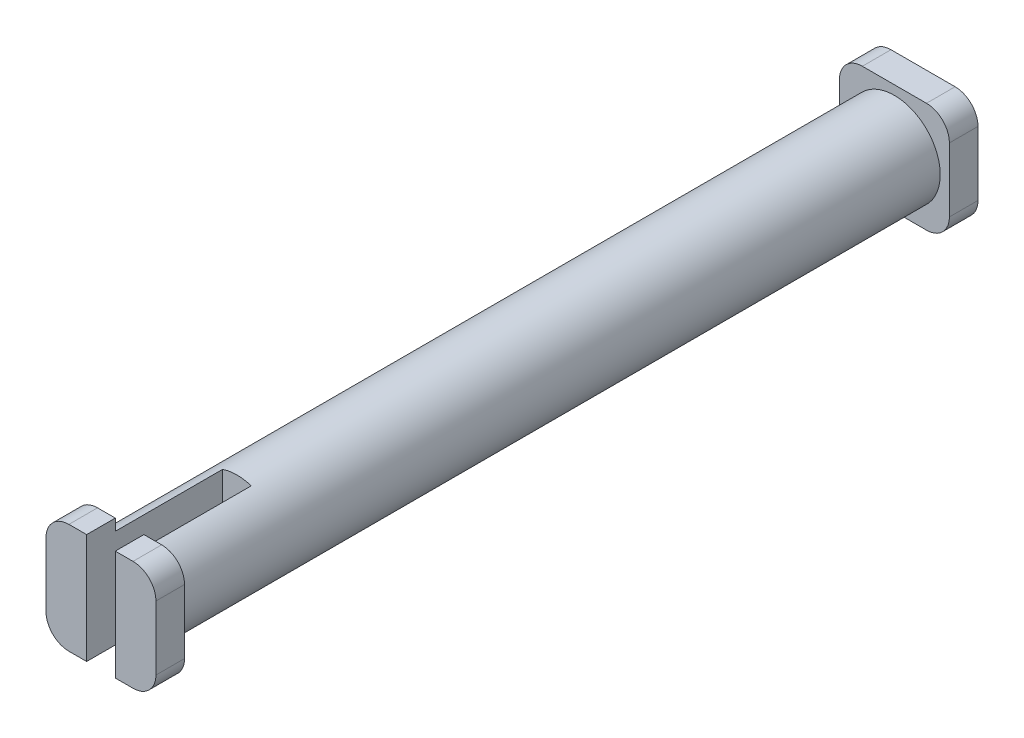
ISO-10303-21;
HEADER;
FILE_DESCRIPTION(('STEP AP214'),'2;1');
FILE_NAME('part.step','',(''),(''),'','','');
FILE_SCHEMA(('AUTOMOTIVE_DESIGN { 1 0 10303 214 1 1 1 1 }'));
ENDSEC;
DATA;
#1=APPLICATION_CONTEXT('core data for automotive mechanical design processes');
#2=APPLICATION_PROTOCOL_DEFINITION('international standard','automotive_design',2000,#1);
#3=PRODUCT_CONTEXT('',#1,'mechanical');
#4=PRODUCT('Part','Part','',(#3));
#5=PRODUCT_RELATED_PRODUCT_CATEGORY('part','',(#4));
#6=PRODUCT_DEFINITION_FORMATION('','',#4);
#7=PRODUCT_DEFINITION_CONTEXT('part definition',#1,'design');
#8=PRODUCT_DEFINITION('design','',#6,#7);
#9=PRODUCT_DEFINITION_SHAPE('','',#8);
#10=(LENGTH_UNIT() NAMED_UNIT(*) SI_UNIT(.MILLI.,.METRE.));
#11=(NAMED_UNIT(*) PLANE_ANGLE_UNIT() SI_UNIT($,.RADIAN.));
#12=(NAMED_UNIT(*) SI_UNIT($,.STERADIAN.) SOLID_ANGLE_UNIT());
#13=UNCERTAINTY_MEASURE_WITH_UNIT(LENGTH_MEASURE(1.E-05),#10,'distance_accuracy_value','');
#14=(GEOMETRIC_REPRESENTATION_CONTEXT(3) GLOBAL_UNCERTAINTY_ASSIGNED_CONTEXT((#13)) GLOBAL_UNIT_ASSIGNED_CONTEXT((#10,
#11,#12)) REPRESENTATION_CONTEXT('',''));
#15=CARTESIAN_POINT('',(0.,0.,0.));
#16=DIRECTION('',(0.,0.,1.));
#17=DIRECTION('',(1.,0.,0.));
#18=AXIS2_PLACEMENT_3D('',#15,#16,#17);
#19=CARTESIAN_POINT('',(1.27000000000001,0.,44.0055));
#20=DIRECTION('',(0.,-1.,0.));
#21=DIRECTION('',(0.,0.,-1.));
#22=AXIS2_PLACEMENT_3D('',#19,#20,#21);
#23=PLANE('',#22);
#24=DIRECTION('',(0.,0.,1.));
#25=VECTOR('',#24,1.);
#26=CARTESIAN_POINT('',(2.25425,0.,38.052375));
#27=LINE('',#26,#25);
#28=CARTESIAN_POINT('',(2.25425,0.,44.0055));
#29=VERTEX_POINT('',#28);
#30=CARTESIAN_POINT('',(2.25425,0.,45.593));
#31=VERTEX_POINT('',#30);
#32=EDGE_CURVE('E371',#29,#31,#27,.T.);
#33=ORIENTED_EDGE('',*,*,#32,.T.);
#34=DIRECTION('',(1.,0.,0.));
#35=VECTOR('',#34,1.);
#36=CARTESIAN_POINT('',(1.27000000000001,0.,45.593));
#37=LINE('',#36,#35);
#38=CARTESIAN_POINT('',(1.27000000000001,0.,45.593));
#39=VERTEX_POINT('',#38);
#40=EDGE_CURVE('E321',#39,#31,#37,.T.);
#41=ORIENTED_EDGE('',*,*,#40,.F.);
#42=DIRECTION('',(0.,0.,1.));
#43=VECTOR('',#42,1.);
#44=CARTESIAN_POINT('',(1.27000000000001,0.,44.0055));
#45=LINE('',#44,#43);
#46=CARTESIAN_POINT('',(1.27000000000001,0.,44.0055));
#47=VERTEX_POINT('',#46);
#48=EDGE_CURVE('E229',#47,#39,#45,.T.);
#49=ORIENTED_EDGE('',*,*,#48,.F.);
#50=DIRECTION('',(1.,0.,0.));
#51=VECTOR('',#50,1.);
#52=CARTESIAN_POINT('',(1.27000000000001,0.,44.0055));
#53=LINE('',#52,#51);
#54=EDGE_CURVE('E283',#47,#29,#53,.T.);
#55=ORIENTED_EDGE('',*,*,#54,.T.);
#56=EDGE_LOOP('',(#33,#41,#49,#55));
#57=FACE_BOUND('',#56,.T.);
#58=ADVANCED_FACE('F39',(#57),#23,.T.);
#59=CARTESIAN_POINT('',(1.27,6.096,44.0055));
#60=DIRECTION('',(0.,1.,0.));
#61=DIRECTION('',(0.,0.,1.));
#62=AXIS2_PLACEMENT_3D('',#59,#60,#61);
#63=PLANE('',#62);
#64=DIRECTION('',(0.,0.,1.));
#65=VECTOR('',#64,1.);
#66=CARTESIAN_POINT('',(2.25425,6.096,38.052375));
#67=LINE('',#66,#65);
#68=CARTESIAN_POINT('',(2.25425,6.096,44.0055));
#69=VERTEX_POINT('',#68);
#70=CARTESIAN_POINT('',(2.25425,6.096,45.593));
#71=VERTEX_POINT('',#70);
#72=EDGE_CURVE('E362',#69,#71,#67,.T.);
#73=ORIENTED_EDGE('',*,*,#72,.F.);
#74=DIRECTION('',(-1.,0.,0.));
#75=VECTOR('',#74,1.);
#76=CARTESIAN_POINT('',(1.27,6.096,44.0055));
#77=LINE('',#76,#75);
#78=CARTESIAN_POINT('',(1.27,6.096,44.0055));
#79=VERTEX_POINT('',#78);
#80=EDGE_CURVE('E268',#69,#79,#77,.T.);
#81=ORIENTED_EDGE('',*,*,#80,.T.);
#82=DIRECTION('',(0.,0.,1.));
#83=VECTOR('',#82,1.);
#84=CARTESIAN_POINT('',(1.27,6.096,44.0055));
#85=LINE('',#84,#83);
#86=CARTESIAN_POINT('',(1.27,6.096,45.593));
#87=VERTEX_POINT('',#86);
#88=EDGE_CURVE('E240',#79,#87,#85,.T.);
#89=ORIENTED_EDGE('',*,*,#88,.T.);
#90=DIRECTION('',(-1.,0.,0.));
#91=VECTOR('',#90,1.);
#92=CARTESIAN_POINT('',(1.27,6.096,45.593));
#93=LINE('',#92,#91);
#94=EDGE_CURVE('E306',#71,#87,#93,.T.);
#95=ORIENTED_EDGE('',*,*,#94,.F.);
#96=EDGE_LOOP('',(#73,#81,#89,#95));
#97=FACE_BOUND('',#96,.T.);
#98=ADVANCED_FACE('F517',(#97),#63,.T.);
#99=CARTESIAN_POINT('',(4.826,1.27,44.0055));
#100=DIRECTION('',(0.,0.,-1.));
#101=DIRECTION('',(1.,0.,0.));
#102=AXIS2_PLACEMENT_3D('',#99,#100,#101);
#103=PLANE('',#102);
#104=DIRECTION('',(0.,1.,0.));
#105=VECTOR('',#104,1.);
#106=CARTESIAN_POINT('',(2.25425,1.27,44.0055));
#107=LINE('',#106,#105);
#108=CARTESIAN_POINT('',(2.25425,0.635208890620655,44.0055));
#109=VERTEX_POINT('',#108);
#110=EDGE_CURVE('E336',#29,#109,#107,.T.);
#111=ORIENTED_EDGE('',*,*,#110,.F.);
#112=ORIENTED_EDGE('',*,*,#54,.F.);
#113=CARTESIAN_POINT('',(1.27,1.27,44.0055));
#114=DIRECTION('',(0.,0.,1.));
#115=DIRECTION('',(-1.,0.,0.));
#116=AXIS2_PLACEMENT_3D('',#113,#114,#115);
#117=CIRCLE('',#116,1.27);
#118=CARTESIAN_POINT('',(0.,1.27,44.0055));
#119=VERTEX_POINT('',#118);
#120=EDGE_CURVE('E279',#119,#47,#117,.T.);
#121=ORIENTED_EDGE('',*,*,#120,.F.);
#122=DIRECTION('',(0.,-1.,0.));
#123=VECTOR('',#122,1.);
#124=CARTESIAN_POINT('',(0.,1.27000000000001,44.0055));
#125=LINE('',#124,#123);
#126=CARTESIAN_POINT('',(0.,4.826,44.0055));
#127=VERTEX_POINT('',#126);
#128=EDGE_CURVE('E275',#127,#119,#125,.T.);
#129=ORIENTED_EDGE('',*,*,#128,.F.);
#130=CARTESIAN_POINT('',(1.27,4.826,44.0055));
#131=DIRECTION('',(0.,0.,1.));
#132=DIRECTION('',(-1.,0.,0.));
#133=AXIS2_PLACEMENT_3D('',#130,#131,#132);
#134=CIRCLE('',#133,1.27);
#135=EDGE_CURVE('E272',#79,#127,#134,.T.);
#136=ORIENTED_EDGE('',*,*,#135,.F.);
#137=ORIENTED_EDGE('',*,*,#80,.F.);
#138=CARTESIAN_POINT('',(2.25425,5.46079110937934,44.0055));
#139=VERTEX_POINT('',#138);
#140=EDGE_CURVE('E342',#139,#69,#107,.T.);
#141=ORIENTED_EDGE('',*,*,#140,.F.);
#142=CARTESIAN_POINT('',(3.048,3.048,44.0055));
#143=DIRECTION('',(0.,0.,1.));
#144=DIRECTION('',(1.,0.,0.));
#145=AXIS2_PLACEMENT_3D('',#142,#143,#144);
#146=CIRCLE('',#145,2.54);
#147=EDGE_CURVE('E159',#139,#109,#146,.T.);
#148=ORIENTED_EDGE('',*,*,#147,.T.);
#149=EDGE_LOOP('',(#111,#112,#121,#129,#136,#137,#141,#148));
#150=FACE_BOUND('',#149,.T.);
#151=ADVANCED_FACE('F513',(#150),#103,.T.);
#152=CARTESIAN_POINT('',(4.826,1.27,45.593));
#153=DIRECTION('',(0.,0.,-1.));
#154=DIRECTION('',(1.,0.,0.));
#155=AXIS2_PLACEMENT_3D('',#152,#153,#154);
#156=PLANE('',#155);
#157=ORIENTED_EDGE('',*,*,#40,.T.);
#158=DIRECTION('',(0.,-1.,0.));
#159=VECTOR('',#158,1.);
#160=CARTESIAN_POINT('',(2.25425,6.096,45.593));
#161=LINE('',#160,#159);
#162=EDGE_CURVE('E386',#71,#31,#161,.T.);
#163=ORIENTED_EDGE('',*,*,#162,.F.);
#164=ORIENTED_EDGE('',*,*,#94,.T.);
#165=CARTESIAN_POINT('',(1.27,4.826,45.593));
#166=DIRECTION('',(0.,0.,1.));
#167=DIRECTION('',(-1.,0.,0.));
#168=AXIS2_PLACEMENT_3D('',#165,#166,#167);
#169=CIRCLE('',#168,1.27);
#170=CARTESIAN_POINT('',(0.,4.826,45.593));
#171=VERTEX_POINT('',#170);
#172=EDGE_CURVE('E310',#87,#171,#169,.T.);
#173=ORIENTED_EDGE('',*,*,#172,.T.);
#174=DIRECTION('',(0.,-1.,0.));
#175=VECTOR('',#174,1.);
#176=CARTESIAN_POINT('',(0.,1.27000000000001,45.593));
#177=LINE('',#176,#175);
#178=CARTESIAN_POINT('',(0.,1.27,45.593));
#179=VERTEX_POINT('',#178);
#180=EDGE_CURVE('E313',#171,#179,#177,.T.);
#181=ORIENTED_EDGE('',*,*,#180,.T.);
#182=CARTESIAN_POINT('',(1.27,1.27,45.593));
#183=DIRECTION('',(0.,0.,1.));
#184=DIRECTION('',(-1.,0.,0.));
#185=AXIS2_PLACEMENT_3D('',#182,#183,#184);
#186=CIRCLE('',#185,1.27);
#187=EDGE_CURVE('E317',#179,#39,#186,.T.);
#188=ORIENTED_EDGE('',*,*,#187,.T.);
#189=EDGE_LOOP('',(#157,#163,#164,#173,#181,#188));
#190=FACE_BOUND('',#189,.T.);
#191=ADVANCED_FACE('F409',(#190),#156,.F.);
#192=CARTESIAN_POINT('',(4.826,1.27,1.5875));
#193=DIRECTION('',(0.,0.,-1.));
#194=DIRECTION('',(-1.,0.,0.));
#195=AXIS2_PLACEMENT_3D('',#192,#193,#194);
#196=CYLINDRICAL_SURFACE('',#195,1.27);
#197=CARTESIAN_POINT('',(4.826,1.27,0.));
#198=DIRECTION('',(0.,0.,1.));
#199=DIRECTION('',(1.,0.,0.));
#200=AXIS2_PLACEMENT_3D('',#197,#198,#199);
#201=CIRCLE('',#200,1.27);
#202=CARTESIAN_POINT('',(4.826,0.,0.));
#203=VERTEX_POINT('',#202);
#204=CARTESIAN_POINT('',(6.096,1.27,0.));
#205=VERTEX_POINT('',#204);
#206=EDGE_CURVE('E154',#203,#205,#201,.T.);
#207=ORIENTED_EDGE('',*,*,#206,.T.);
#208=DIRECTION('',(0.,0.,-1.));
#209=VECTOR('',#208,1.);
#210=CARTESIAN_POINT('',(6.096,1.27,1.5875));
#211=LINE('',#210,#209);
#212=CARTESIAN_POINT('',(6.096,1.27,1.5875));
#213=VERTEX_POINT('',#212);
#214=EDGE_CURVE('E196',#213,#205,#211,.T.);
#215=ORIENTED_EDGE('',*,*,#214,.F.);
#216=CARTESIAN_POINT('',(4.826,1.27,1.5875));
#217=DIRECTION('',(0.,0.,1.));
#218=DIRECTION('',(1.,0.,0.));
#219=AXIS2_PLACEMENT_3D('',#216,#217,#218);
#220=CIRCLE('',#219,1.27);
#221=CARTESIAN_POINT('',(4.826,0.,1.5875));
#222=VERTEX_POINT('',#221);
#223=EDGE_CURVE('E178',#222,#213,#220,.T.);
#224=ORIENTED_EDGE('',*,*,#223,.F.);
#225=DIRECTION('',(0.,0.,-1.));
#226=VECTOR('',#225,1.);
#227=CARTESIAN_POINT('',(4.826,0.,1.5875));
#228=LINE('',#227,#226);
#229=EDGE_CURVE('E150',#222,#203,#228,.T.);
#230=ORIENTED_EDGE('',*,*,#229,.T.);
#231=EDGE_LOOP('',(#207,#215,#224,#230));
#232=FACE_BOUND('',#231,.T.);
#233=ADVANCED_FACE('F41',(#232),#196,.T.);
#234=CARTESIAN_POINT('',(6.096,1.27,1.5875));
#235=DIRECTION('',(-1.,0.,0.));
#236=DIRECTION('',(0.,-1.,0.));
#237=AXIS2_PLACEMENT_3D('',#234,#235,#236);
#238=PLANE('',#237);
#239=DIRECTION('',(0.,1.,0.));
#240=VECTOR('',#239,1.);
#241=CARTESIAN_POINT('',(6.096,1.27,0.));
#242=LINE('',#241,#240);
#243=CARTESIAN_POINT('',(6.096,4.826,0.));
#244=VERTEX_POINT('',#243);
#245=EDGE_CURVE('E158',#205,#244,#242,.T.);
#246=ORIENTED_EDGE('',*,*,#245,.T.);
#247=DIRECTION('',(0.,0.,-1.));
#248=VECTOR('',#247,1.);
#249=CARTESIAN_POINT('',(6.096,4.826,1.5875));
#250=LINE('',#249,#248);
#251=CARTESIAN_POINT('',(6.096,4.826,1.5875));
#252=VERTEX_POINT('',#251);
#253=EDGE_CURVE('E193',#252,#244,#250,.T.);
#254=ORIENTED_EDGE('',*,*,#253,.F.);
#255=DIRECTION('',(0.,1.,0.));
#256=VECTOR('',#255,1.);
#257=CARTESIAN_POINT('',(6.096,1.27,1.5875));
#258=LINE('',#257,#256);
#259=EDGE_CURVE('E106',#213,#252,#258,.T.);
#260=ORIENTED_EDGE('',*,*,#259,.F.);
#261=ORIENTED_EDGE('',*,*,#214,.T.);
#262=EDGE_LOOP('',(#246,#254,#260,#261));
#263=FACE_BOUND('',#262,.T.);
#264=ADVANCED_FACE('F706',(#263),#238,.F.);
#265=CARTESIAN_POINT('',(4.826,4.826,1.5875));
#266=DIRECTION('',(0.,0.,-1.));
#267=DIRECTION('',(-1.,0.,0.));
#268=AXIS2_PLACEMENT_3D('',#265,#266,#267);
#269=CYLINDRICAL_SURFACE('',#268,1.27);
#270=CARTESIAN_POINT('',(4.826,4.826,0.));
#271=DIRECTION('',(0.,0.,1.));
#272=DIRECTION('',(-1.,0.,0.));
#273=AXIS2_PLACEMENT_3D('',#270,#271,#272);
#274=CIRCLE('',#273,1.27);
#275=CARTESIAN_POINT('',(4.826,6.096,0.));
#276=VERTEX_POINT('',#275);
#277=EDGE_CURVE('E162',#244,#276,#274,.T.);
#278=ORIENTED_EDGE('',*,*,#277,.T.);
#279=DIRECTION('',(0.,0.,-1.));
#280=VECTOR('',#279,1.);
#281=CARTESIAN_POINT('',(4.826,6.096,1.5875));
#282=LINE('',#281,#280);
#283=CARTESIAN_POINT('',(4.826,6.096,1.5875));
#284=VERTEX_POINT('',#283);
#285=EDGE_CURVE('E189',#284,#276,#282,.T.);
#286=ORIENTED_EDGE('',*,*,#285,.F.);
#287=CARTESIAN_POINT('',(4.826,4.826,1.5875));
#288=DIRECTION('',(0.,0.,1.));
#289=DIRECTION('',(-1.,0.,0.));
#290=AXIS2_PLACEMENT_3D('',#287,#288,#289);
#291=CIRCLE('',#290,1.27);
#292=EDGE_CURVE('E215',#252,#284,#291,.T.);
#293=ORIENTED_EDGE('',*,*,#292,.F.);
#294=ORIENTED_EDGE('',*,*,#253,.T.);
#295=EDGE_LOOP('',(#278,#286,#293,#294));
#296=FACE_BOUND('',#295,.T.);
#297=ADVANCED_FACE('F696',(#296),#269,.T.);
#298=CARTESIAN_POINT('',(1.27,6.096,1.5875));
#299=DIRECTION('',(0.,-1.,0.));
#300=DIRECTION('',(0.,0.,-1.));
#301=AXIS2_PLACEMENT_3D('',#298,#299,#300);
#302=PLANE('',#301);
#303=DIRECTION('',(-1.,0.,0.));
#304=VECTOR('',#303,1.);
#305=CARTESIAN_POINT('',(1.27,6.096,0.));
#306=LINE('',#305,#304);
#307=CARTESIAN_POINT('',(1.27,6.096,0.));
#308=VERTEX_POINT('',#307);
#309=EDGE_CURVE('E165',#276,#308,#306,.T.);
#310=ORIENTED_EDGE('',*,*,#309,.T.);
#311=DIRECTION('',(0.,0.,-1.));
#312=VECTOR('',#311,1.);
#313=CARTESIAN_POINT('',(1.27,6.096,1.5875));
#314=LINE('',#313,#312);
#315=CARTESIAN_POINT('',(1.27,6.096,1.5875));
#316=VERTEX_POINT('',#315);
#317=EDGE_CURVE('E185',#316,#308,#314,.T.);
#318=ORIENTED_EDGE('',*,*,#317,.F.);
#319=DIRECTION('',(-1.,0.,0.));
#320=VECTOR('',#319,1.);
#321=CARTESIAN_POINT('',(1.27,6.096,1.5875));
#322=LINE('',#321,#320);
#323=EDGE_CURVE('E218',#284,#316,#322,.T.);
#324=ORIENTED_EDGE('',*,*,#323,.F.);
#325=ORIENTED_EDGE('',*,*,#285,.T.);
#326=EDGE_LOOP('',(#310,#318,#324,#325));
#327=FACE_BOUND('',#326,.T.);
#328=ADVANCED_FACE('F686',(#327),#302,.F.);
#329=CARTESIAN_POINT('',(1.27,4.826,1.5875));
#330=DIRECTION('',(0.,0.,-1.));
#331=DIRECTION('',(-1.,0.,0.));
#332=AXIS2_PLACEMENT_3D('',#329,#330,#331);
#333=CYLINDRICAL_SURFACE('',#332,1.27);
#334=CARTESIAN_POINT('',(1.27,4.826,0.));
#335=DIRECTION('',(0.,0.,1.));
#336=DIRECTION('',(-1.,0.,0.));
#337=AXIS2_PLACEMENT_3D('',#334,#335,#336);
#338=CIRCLE('',#337,1.27);
#339=CARTESIAN_POINT('',(0.,4.826,0.));
#340=VERTEX_POINT('',#339);
#341=EDGE_CURVE('E168',#308,#340,#338,.T.);
#342=ORIENTED_EDGE('',*,*,#341,.T.);
#343=DIRECTION('',(0.,0.,-1.));
#344=VECTOR('',#343,1.);
#345=CARTESIAN_POINT('',(0.,4.826,1.5875));
#346=LINE('',#345,#344);
#347=CARTESIAN_POINT('',(0.,4.826,1.5875));
#348=VERTEX_POINT('',#347);
#349=EDGE_CURVE('E143',#348,#340,#346,.T.);
#350=ORIENTED_EDGE('',*,*,#349,.F.);
#351=CARTESIAN_POINT('',(1.27,4.826,1.5875));
#352=DIRECTION('',(0.,0.,1.));
#353=DIRECTION('',(-1.,0.,0.));
#354=AXIS2_PLACEMENT_3D('',#351,#352,#353);
#355=CIRCLE('',#354,1.27);
#356=EDGE_CURVE('E129',#316,#348,#355,.T.);
#357=ORIENTED_EDGE('',*,*,#356,.F.);
#358=ORIENTED_EDGE('',*,*,#317,.T.);
#359=EDGE_LOOP('',(#342,#350,#357,#358));
#360=FACE_BOUND('',#359,.T.);
#361=ADVANCED_FACE('F677',(#360),#333,.T.);
#362=CARTESIAN_POINT('',(0.,1.27000000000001,1.5875));
#363=DIRECTION('',(1.,0.,0.));
#364=DIRECTION('',(0.,1.,0.));
#365=AXIS2_PLACEMENT_3D('',#362,#363,#364);
#366=PLANE('',#365);
#367=DIRECTION('',(0.,-1.,0.));
#368=VECTOR('',#367,1.);
#369=CARTESIAN_POINT('',(0.,1.27000000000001,0.));
#370=LINE('',#369,#368);
#371=CARTESIAN_POINT('',(0.,1.27,0.));
#372=VERTEX_POINT('',#371);
#373=EDGE_CURVE('E139',#340,#372,#370,.T.);
#374=ORIENTED_EDGE('',*,*,#373,.T.);
#375=DIRECTION('',(0.,0.,-1.));
#376=VECTOR('',#375,1.);
#377=CARTESIAN_POINT('',(0.,1.27,1.5875));
#378=LINE('',#377,#376);
#379=CARTESIAN_POINT('',(0.,1.27,1.5875));
#380=VERTEX_POINT('',#379);
#381=EDGE_CURVE('E136',#380,#372,#378,.T.);
#382=ORIENTED_EDGE('',*,*,#381,.F.);
#383=DIRECTION('',(0.,-1.,0.));
#384=VECTOR('',#383,1.);
#385=CARTESIAN_POINT('',(0.,1.27000000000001,1.5875));
#386=LINE('',#385,#384);
#387=EDGE_CURVE('E122',#348,#380,#386,.T.);
#388=ORIENTED_EDGE('',*,*,#387,.F.);
#389=ORIENTED_EDGE('',*,*,#349,.T.);
#390=EDGE_LOOP('',(#374,#382,#388,#389));
#391=FACE_BOUND('',#390,.T.);
#392=ADVANCED_FACE('F137',(#391),#366,.F.);
#393=CARTESIAN_POINT('',(1.27,1.27,1.5875));
#394=DIRECTION('',(0.,0.,-1.));
#395=DIRECTION('',(-1.,0.,0.));
#396=AXIS2_PLACEMENT_3D('',#393,#394,#395);
#397=CYLINDRICAL_SURFACE('',#396,1.27);
#398=CARTESIAN_POINT('',(1.27,1.27,0.));
#399=DIRECTION('',(0.,0.,1.));
#400=DIRECTION('',(-1.,0.,0.));
#401=AXIS2_PLACEMENT_3D('',#398,#399,#400);
#402=CIRCLE('',#401,1.27);
#403=CARTESIAN_POINT('',(1.27000000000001,0.,0.));
#404=VERTEX_POINT('',#403);
#405=EDGE_CURVE('E173',#372,#404,#402,.T.);
#406=ORIENTED_EDGE('',*,*,#405,.T.);
#407=DIRECTION('',(0.,0.,-1.));
#408=VECTOR('',#407,1.);
#409=CARTESIAN_POINT('',(1.27000000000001,0.,1.5875));
#410=LINE('',#409,#408);
#411=CARTESIAN_POINT('',(1.27000000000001,0.,1.5875));
#412=VERTEX_POINT('',#411);
#413=EDGE_CURVE('E144',#412,#404,#410,.T.);
#414=ORIENTED_EDGE('',*,*,#413,.F.);
#415=CARTESIAN_POINT('',(1.27,1.27,1.5875));
#416=DIRECTION('',(0.,0.,1.));
#417=DIRECTION('',(-1.,0.,0.));
#418=AXIS2_PLACEMENT_3D('',#415,#416,#417);
#419=CIRCLE('',#418,1.27);
#420=EDGE_CURVE('E126',#380,#412,#419,.T.);
#421=ORIENTED_EDGE('',*,*,#420,.F.);
#422=ORIENTED_EDGE('',*,*,#381,.T.);
#423=EDGE_LOOP('',(#406,#414,#421,#422));
#424=FACE_BOUND('',#423,.T.);
#425=ADVANCED_FACE('F146',(#424),#397,.T.);
#426=CARTESIAN_POINT('',(1.27000000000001,0.,1.5875));
#427=DIRECTION('',(0.,1.,0.));
#428=DIRECTION('',(0.,0.,1.));
#429=AXIS2_PLACEMENT_3D('',#426,#427,#428);
#430=PLANE('',#429);
#431=DIRECTION('',(1.,0.,0.));
#432=VECTOR('',#431,1.);
#433=CARTESIAN_POINT('',(1.27000000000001,0.,0.));
#434=LINE('',#433,#432);
#435=EDGE_CURVE('E97',#404,#203,#434,.T.);
#436=ORIENTED_EDGE('',*,*,#435,.T.);
#437=ORIENTED_EDGE('',*,*,#229,.F.);
#438=DIRECTION('',(1.,0.,0.));
#439=VECTOR('',#438,1.);
#440=CARTESIAN_POINT('',(1.27000000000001,0.,1.5875));
#441=LINE('',#440,#439);
#442=EDGE_CURVE('E64',#412,#222,#441,.T.);
#443=ORIENTED_EDGE('',*,*,#442,.F.);
#444=ORIENTED_EDGE('',*,*,#413,.T.);
#445=EDGE_LOOP('',(#436,#437,#443,#444));
#446=FACE_BOUND('',#445,.T.);
#447=ADVANCED_FACE('F644',(#446),#430,.F.);
#448=CARTESIAN_POINT('',(4.826,1.27,1.5875));
#449=DIRECTION('',(0.,0.,1.));
#450=DIRECTION('',(1.,0.,0.));
#451=AXIS2_PLACEMENT_3D('',#448,#449,#450);
#452=PLANE('',#451);
#453=CARTESIAN_POINT('',(3.048,3.048,1.5875));
#454=DIRECTION('',(0.,0.,1.));
#455=DIRECTION('',(1.,0.,0.));
#456=AXIS2_PLACEMENT_3D('',#453,#454,#455);
#457=CIRCLE('',#456,2.54);
#458=CARTESIAN_POINT('',(5.588,3.048,1.5875));
#459=VERTEX_POINT('',#458);
#460=EDGE_CURVE('E198',#459,#459,#457,.T.);
#461=ORIENTED_EDGE('',*,*,#460,.F.);
#462=EDGE_LOOP('',(#461));
#463=FACE_BOUND('',#462,.T.);
#464=ORIENTED_EDGE('',*,*,#223,.T.);
#465=ORIENTED_EDGE('',*,*,#259,.T.);
#466=ORIENTED_EDGE('',*,*,#292,.T.);
#467=ORIENTED_EDGE('',*,*,#323,.T.);
#468=ORIENTED_EDGE('',*,*,#356,.T.);
#469=ORIENTED_EDGE('',*,*,#387,.T.);
#470=ORIENTED_EDGE('',*,*,#420,.T.);
#471=ORIENTED_EDGE('',*,*,#442,.T.);
#472=EDGE_LOOP('',(#464,#465,#466,#467,#468,#469,#470,#471));
#473=FACE_BOUND('',#472,.T.);
#474=ADVANCED_FACE('F124',(#463,#473),#452,.T.);
#475=CARTESIAN_POINT('',(4.826,1.27,0.));
#476=DIRECTION('',(0.,0.,1.));
#477=DIRECTION('',(1.,0.,0.));
#478=AXIS2_PLACEMENT_3D('',#475,#476,#477);
#479=PLANE('',#478);
#480=ORIENTED_EDGE('',*,*,#206,.F.);
#481=ORIENTED_EDGE('',*,*,#435,.F.);
#482=ORIENTED_EDGE('',*,*,#405,.F.);
#483=ORIENTED_EDGE('',*,*,#373,.F.);
#484=ORIENTED_EDGE('',*,*,#341,.F.);
#485=ORIENTED_EDGE('',*,*,#309,.F.);
#486=ORIENTED_EDGE('',*,*,#277,.F.);
#487=ORIENTED_EDGE('',*,*,#245,.F.);
#488=EDGE_LOOP('',(#480,#481,#482,#483,#484,#485,#486,#487));
#489=FACE_BOUND('',#488,.T.);
#490=ADVANCED_FACE('F608',(#489),#479,.F.);
#491=CARTESIAN_POINT('',(3.048,3.048,44.0055));
#492=DIRECTION('',(0.,0.,-1.));
#493=DIRECTION('',(-1.,0.,0.));
#494=AXIS2_PLACEMENT_3D('',#491,#492,#493);
#495=CYLINDRICAL_SURFACE('',#494,2.54);
#496=ORIENTED_EDGE('',*,*,#147,.F.);
#497=DIRECTION('',(0.,0.,-1.));
#498=VECTOR('',#497,1.);
#499=CARTESIAN_POINT('',(2.25425,5.46079110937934,44.0055));
#500=LINE('',#499,#498);
#501=CARTESIAN_POINT('',(2.25425,5.46079110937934,38.052375));
#502=VERTEX_POINT('',#501);
#503=EDGE_CURVE('E340',#139,#502,#500,.T.);
#504=ORIENTED_EDGE('',*,*,#503,.T.);
#505=CARTESIAN_POINT('',(3.048,3.048,38.052375));
#506=DIRECTION('',(0.,0.,1.));
#507=DIRECTION('',(1.,0.,0.));
#508=AXIS2_PLACEMENT_3D('',#505,#506,#507);
#509=CIRCLE('',#508,2.54);
#510=CARTESIAN_POINT('',(3.84175,5.46079110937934,38.052375));
#511=VERTEX_POINT('',#510);
#512=EDGE_CURVE('E11',#511,#502,#509,.T.);
#513=ORIENTED_EDGE('',*,*,#512,.F.);
#514=DIRECTION('',(0.,0.,-1.));
#515=VECTOR('',#514,1.);
#516=CARTESIAN_POINT('',(3.84175,5.46079110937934,44.0055));
#517=LINE('',#516,#515);
#518=CARTESIAN_POINT('',(3.84175,5.46079110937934,44.0055));
#519=VERTEX_POINT('',#518);
#520=EDGE_CURVE('E348',#511,#519,#517,.F.);
#521=ORIENTED_EDGE('',*,*,#520,.T.);
#522=CARTESIAN_POINT('',(3.84175,0.635208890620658,44.0055));
#523=VERTEX_POINT('',#522);
#524=EDGE_CURVE('E209',#523,#519,#146,.T.);
#525=ORIENTED_EDGE('',*,*,#524,.F.);
#526=DIRECTION('',(0.,0.,-1.));
#527=VECTOR('',#526,1.);
#528=CARTESIAN_POINT('',(3.84175,0.635208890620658,44.0055));
#529=LINE('',#528,#527);
#530=CARTESIAN_POINT('',(3.84175,0.635208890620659,38.052375));
#531=VERTEX_POINT('',#530);
#532=EDGE_CURVE('E355',#523,#531,#529,.T.);
#533=ORIENTED_EDGE('',*,*,#532,.T.);
#534=CARTESIAN_POINT('',(2.25425,0.635208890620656,38.052375));
#535=VERTEX_POINT('',#534);
#536=EDGE_CURVE('E43',#535,#531,#509,.T.);
#537=ORIENTED_EDGE('',*,*,#536,.F.);
#538=DIRECTION('',(0.,0.,-1.));
#539=VECTOR('',#538,1.);
#540=CARTESIAN_POINT('',(2.25425,0.635208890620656,44.0055));
#541=LINE('',#540,#539);
#542=EDGE_CURVE('E332',#535,#109,#541,.F.);
#543=ORIENTED_EDGE('',*,*,#542,.T.);
#544=EDGE_LOOP('',(#496,#504,#513,#521,#525,#533,#537,#543));
#545=FACE_BOUND('',#544,.T.);
#546=ORIENTED_EDGE('',*,*,#460,.T.);
#547=EDGE_LOOP('',(#546));
#548=FACE_BOUND('',#547,.T.);
#549=ADVANCED_FACE('F508',(#545,#548),#495,.T.);
#550=CARTESIAN_POINT('',(4.826,1.27,44.0055));
#551=DIRECTION('',(0.,0.,1.));
#552=DIRECTION('',(1.,0.,0.));
#553=AXIS2_PLACEMENT_3D('',#550,#551,#552);
#554=CYLINDRICAL_SURFACE('',#553,1.27);
#555=CARTESIAN_POINT('',(4.826,1.27,45.593));
#556=DIRECTION('',(0.,0.,1.));
#557=DIRECTION('',(1.,0.,0.));
#558=AXIS2_PLACEMENT_3D('',#555,#556,#557);
#559=CIRCLE('',#558,1.27);
#560=CARTESIAN_POINT('',(4.826,0.,45.593));
#561=VERTEX_POINT('',#560);
#562=CARTESIAN_POINT('',(6.096,1.27,45.593));
#563=VERTEX_POINT('',#562);
#564=EDGE_CURVE('E329',#561,#563,#559,.T.);
#565=ORIENTED_EDGE('',*,*,#564,.F.);
#566=DIRECTION('',(0.,0.,1.));
#567=VECTOR('',#566,1.);
#568=CARTESIAN_POINT('',(4.826,0.,44.0055));
#569=LINE('',#568,#567);
#570=CARTESIAN_POINT('',(4.826,0.,44.0055));
#571=VERTEX_POINT('',#570);
#572=EDGE_CURVE('E226',#571,#561,#569,.T.);
#573=ORIENTED_EDGE('',*,*,#572,.F.);
#574=CARTESIAN_POINT('',(4.826,1.27,44.0055));
#575=DIRECTION('',(0.,0.,1.));
#576=DIRECTION('',(1.,0.,0.));
#577=AXIS2_PLACEMENT_3D('',#574,#575,#576);
#578=CIRCLE('',#577,1.27);
#579=CARTESIAN_POINT('',(6.096,1.27,44.0055));
#580=VERTEX_POINT('',#579);
#581=EDGE_CURVE('E291',#571,#580,#578,.T.);
#582=ORIENTED_EDGE('',*,*,#581,.T.);
#583=DIRECTION('',(0.,0.,1.));
#584=VECTOR('',#583,1.);
#585=CARTESIAN_POINT('',(6.096,1.27,44.0055));
#586=LINE('',#585,#584);
#587=EDGE_CURVE('E252',#580,#563,#586,.T.);
#588=ORIENTED_EDGE('',*,*,#587,.T.);
#589=EDGE_LOOP('',(#565,#573,#582,#588));
#590=FACE_BOUND('',#589,.T.);
#591=ADVANCED_FACE('F541',(#590),#554,.T.);
#592=DIRECTION('',(0.,0.,1.));
#593=VECTOR('',#592,1.);
#594=CARTESIAN_POINT('',(3.84175,0.,38.052375));
#595=LINE('',#594,#593);
#596=CARTESIAN_POINT('',(3.84175,0.,44.0055));
#597=VERTEX_POINT('',#596);
#598=CARTESIAN_POINT('',(3.84175,0.,45.593));
#599=VERTEX_POINT('',#598);
#600=EDGE_CURVE('E55',#597,#599,#595,.T.);
#601=ORIENTED_EDGE('',*,*,#600,.F.);
#602=EDGE_CURVE('E287',#597,#571,#53,.T.);
#603=ORIENTED_EDGE('',*,*,#602,.T.);
#604=ORIENTED_EDGE('',*,*,#572,.T.);
#605=EDGE_CURVE('E325',#599,#561,#37,.T.);
#606=ORIENTED_EDGE('',*,*,#605,.F.);
#607=EDGE_LOOP('',(#601,#603,#604,#606));
#608=FACE_BOUND('',#607,.T.);
#609=ADVANCED_FACE('F531',(#608),#23,.T.);
#610=CARTESIAN_POINT('',(1.27,1.27,44.0055));
#611=DIRECTION('',(0.,0.,1.));
#612=DIRECTION('',(1.,0.,0.));
#613=AXIS2_PLACEMENT_3D('',#610,#611,#612);
#614=CYLINDRICAL_SURFACE('',#613,1.27);
#615=ORIENTED_EDGE('',*,*,#187,.F.);
#616=DIRECTION('',(0.,0.,1.));
#617=VECTOR('',#616,1.);
#618=CARTESIAN_POINT('',(0.,1.27,44.0055));
#619=LINE('',#618,#617);
#620=EDGE_CURVE('E232',#119,#179,#619,.T.);
#621=ORIENTED_EDGE('',*,*,#620,.F.);
#622=ORIENTED_EDGE('',*,*,#120,.T.);
#623=ORIENTED_EDGE('',*,*,#48,.T.);
#624=EDGE_LOOP('',(#615,#621,#622,#623));
#625=FACE_BOUND('',#624,.T.);
#626=ADVANCED_FACE('F417',(#625),#614,.T.);
#627=CARTESIAN_POINT('',(0.,1.27000000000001,44.0055));
#628=DIRECTION('',(-1.,0.,0.));
#629=DIRECTION('',(0.,-1.,0.));
#630=AXIS2_PLACEMENT_3D('',#627,#628,#629);
#631=PLANE('',#630);
#632=ORIENTED_EDGE('',*,*,#180,.F.);
#633=DIRECTION('',(0.,0.,1.));
#634=VECTOR('',#633,1.);
#635=CARTESIAN_POINT('',(0.,4.826,44.0055));
#636=LINE('',#635,#634);
#637=EDGE_CURVE('E236',#127,#171,#636,.T.);
#638=ORIENTED_EDGE('',*,*,#637,.F.);
#639=ORIENTED_EDGE('',*,*,#128,.T.);
#640=ORIENTED_EDGE('',*,*,#620,.T.);
#641=EDGE_LOOP('',(#632,#638,#639,#640));
#642=FACE_BOUND('',#641,.T.);
#643=ADVANCED_FACE('F523',(#642),#631,.T.);
#644=CARTESIAN_POINT('',(1.27,4.826,44.0055));
#645=DIRECTION('',(0.,0.,1.));
#646=DIRECTION('',(1.,0.,0.));
#647=AXIS2_PLACEMENT_3D('',#644,#645,#646);
#648=CYLINDRICAL_SURFACE('',#647,1.27);
#649=ORIENTED_EDGE('',*,*,#172,.F.);
#650=ORIENTED_EDGE('',*,*,#88,.F.);
#651=ORIENTED_EDGE('',*,*,#135,.T.);
#652=ORIENTED_EDGE('',*,*,#637,.T.);
#653=EDGE_LOOP('',(#649,#650,#651,#652));
#654=FACE_BOUND('',#653,.T.);
#655=ADVANCED_FACE('F521',(#654),#648,.T.);
#656=DIRECTION('',(0.,0.,1.));
#657=VECTOR('',#656,1.);
#658=CARTESIAN_POINT('',(3.84175,6.096,38.052375));
#659=LINE('',#658,#657);
#660=CARTESIAN_POINT('',(3.84175,6.096,44.0055));
#661=VERTEX_POINT('',#660);
#662=CARTESIAN_POINT('',(3.84175,6.096,45.593));
#663=VERTEX_POINT('',#662);
#664=EDGE_CURVE('E365',#661,#663,#659,.T.);
#665=ORIENTED_EDGE('',*,*,#664,.T.);
#666=CARTESIAN_POINT('',(4.826,6.096,45.593));
#667=VERTEX_POINT('',#666);
#668=EDGE_CURVE('E302',#667,#663,#93,.T.);
#669=ORIENTED_EDGE('',*,*,#668,.F.);
#670=DIRECTION('',(0.,0.,1.));
#671=VECTOR('',#670,1.);
#672=CARTESIAN_POINT('',(4.826,6.096,44.0055));
#673=LINE('',#672,#671);
#674=CARTESIAN_POINT('',(4.826,6.096,44.0055));
#675=VERTEX_POINT('',#674);
#676=EDGE_CURVE('E244',#675,#667,#673,.T.);
#677=ORIENTED_EDGE('',*,*,#676,.F.);
#678=EDGE_CURVE('E264',#675,#661,#77,.T.);
#679=ORIENTED_EDGE('',*,*,#678,.T.);
#680=EDGE_LOOP('',(#665,#669,#677,#679));
#681=FACE_BOUND('',#680,.T.);
#682=ADVANCED_FACE('F494',(#681),#63,.T.);
#683=CARTESIAN_POINT('',(4.826,4.826,44.0055));
#684=DIRECTION('',(0.,0.,1.));
#685=DIRECTION('',(1.,0.,0.));
#686=AXIS2_PLACEMENT_3D('',#683,#684,#685);
#687=CYLINDRICAL_SURFACE('',#686,1.27);
#688=CARTESIAN_POINT('',(4.826,4.826,45.593));
#689=DIRECTION('',(0.,0.,1.));
#690=DIRECTION('',(-1.,0.,0.));
#691=AXIS2_PLACEMENT_3D('',#688,#689,#690);
#692=CIRCLE('',#691,1.27);
#693=CARTESIAN_POINT('',(6.096,4.826,45.593));
#694=VERTEX_POINT('',#693);
#695=EDGE_CURVE('E298',#694,#667,#692,.T.);
#696=ORIENTED_EDGE('',*,*,#695,.F.);
#697=DIRECTION('',(0.,0.,1.));
#698=VECTOR('',#697,1.);
#699=CARTESIAN_POINT('',(6.096,4.826,44.0055));
#700=LINE('',#699,#698);
#701=CARTESIAN_POINT('',(6.096,4.826,44.0055));
#702=VERTEX_POINT('',#701);
#703=EDGE_CURVE('E248',#702,#694,#700,.T.);
#704=ORIENTED_EDGE('',*,*,#703,.F.);
#705=CARTESIAN_POINT('',(4.826,4.826,44.0055));
#706=DIRECTION('',(0.,0.,1.));
#707=DIRECTION('',(-1.,0.,0.));
#708=AXIS2_PLACEMENT_3D('',#705,#706,#707);
#709=CIRCLE('',#708,1.27);
#710=EDGE_CURVE('E260',#702,#675,#709,.T.);
#711=ORIENTED_EDGE('',*,*,#710,.T.);
#712=ORIENTED_EDGE('',*,*,#676,.T.);
#713=EDGE_LOOP('',(#696,#704,#711,#712));
#714=FACE_BOUND('',#713,.T.);
#715=ADVANCED_FACE('F498',(#714),#687,.T.);
#716=CARTESIAN_POINT('',(6.096,1.27,44.0055));
#717=DIRECTION('',(1.,0.,0.));
#718=DIRECTION('',(0.,1.,0.));
#719=AXIS2_PLACEMENT_3D('',#716,#717,#718);
#720=PLANE('',#719);
#721=DIRECTION('',(0.,1.,0.));
#722=VECTOR('',#721,1.);
#723=CARTESIAN_POINT('',(6.096,1.27,45.593));
#724=LINE('',#723,#722);
#725=EDGE_CURVE('E294',#563,#694,#724,.T.);
#726=ORIENTED_EDGE('',*,*,#725,.F.);
#727=ORIENTED_EDGE('',*,*,#587,.F.);
#728=DIRECTION('',(0.,1.,0.));
#729=VECTOR('',#728,1.);
#730=CARTESIAN_POINT('',(6.096,1.27,44.0055));
#731=LINE('',#730,#729);
#732=EDGE_CURVE('E256',#580,#702,#731,.T.);
#733=ORIENTED_EDGE('',*,*,#732,.T.);
#734=ORIENTED_EDGE('',*,*,#703,.T.);
#735=EDGE_LOOP('',(#726,#727,#733,#734));
#736=FACE_BOUND('',#735,.T.);
#737=ADVANCED_FACE('F546',(#736),#720,.T.);
#738=DIRECTION('',(0.,-1.,0.));
#739=VECTOR('',#738,1.);
#740=CARTESIAN_POINT('',(3.84175,1.27,44.0055));
#741=LINE('',#740,#739);
#742=EDGE_CURVE('E351',#661,#519,#741,.T.);
#743=ORIENTED_EDGE('',*,*,#742,.F.);
#744=ORIENTED_EDGE('',*,*,#678,.F.);
#745=ORIENTED_EDGE('',*,*,#710,.F.);
#746=ORIENTED_EDGE('',*,*,#732,.F.);
#747=ORIENTED_EDGE('',*,*,#581,.F.);
#748=ORIENTED_EDGE('',*,*,#602,.F.);
#749=EDGE_CURVE('E357',#523,#597,#741,.T.);
#750=ORIENTED_EDGE('',*,*,#749,.F.);
#751=ORIENTED_EDGE('',*,*,#524,.T.);
#752=EDGE_LOOP('',(#743,#744,#745,#746,#747,#748,#750,#751));
#753=FACE_BOUND('',#752,.T.);
#754=ADVANCED_FACE('F501',(#753),#103,.T.);
#755=ORIENTED_EDGE('',*,*,#668,.T.);
#756=DIRECTION('',(0.,1.,0.));
#757=VECTOR('',#756,1.);
#758=CARTESIAN_POINT('',(3.84175,6.096,45.593));
#759=LINE('',#758,#757);
#760=EDGE_CURVE('E383',#599,#663,#759,.T.);
#761=ORIENTED_EDGE('',*,*,#760,.F.);
#762=ORIENTED_EDGE('',*,*,#605,.T.);
#763=ORIENTED_EDGE('',*,*,#564,.T.);
#764=ORIENTED_EDGE('',*,*,#725,.T.);
#765=ORIENTED_EDGE('',*,*,#695,.T.);
#766=EDGE_LOOP('',(#755,#761,#762,#763,#764,#765));
#767=FACE_BOUND('',#766,.T.);
#768=ADVANCED_FACE('F496',(#767),#156,.F.);
#769=CARTESIAN_POINT('',(0.,0.,38.052375));
#770=DIRECTION('',(0.,0.,1.));
#771=DIRECTION('',(1.,0.,0.));
#772=AXIS2_PLACEMENT_3D('',#769,#770,#771);
#773=PLANE('',#772);
#774=ORIENTED_EDGE('',*,*,#512,.T.);
#775=DIRECTION('',(0.,-1.,0.));
#776=VECTOR('',#775,1.);
#777=CARTESIAN_POINT('',(2.25425,6.096,38.052375));
#778=LINE('',#777,#776);
#779=EDGE_CURVE('E379',#502,#535,#778,.T.);
#780=ORIENTED_EDGE('',*,*,#779,.T.);
#781=ORIENTED_EDGE('',*,*,#536,.T.);
#782=DIRECTION('',(0.,1.,0.));
#783=VECTOR('',#782,1.);
#784=CARTESIAN_POINT('',(3.84175,6.096,38.052375));
#785=LINE('',#784,#783);
#786=EDGE_CURVE('E375',#531,#511,#785,.T.);
#787=ORIENTED_EDGE('',*,*,#786,.T.);
#788=EDGE_LOOP('',(#774,#780,#781,#787));
#789=FACE_BOUND('',#788,.T.);
#790=ADVANCED_FACE('F510',(#789),#773,.T.);
#791=CARTESIAN_POINT('',(2.25425,6.096,38.052375));
#792=DIRECTION('',(-1.,0.,0.));
#793=DIRECTION('',(0.,-1.,0.));
#794=AXIS2_PLACEMENT_3D('',#791,#792,#793);
#795=PLANE('',#794);
#796=ORIENTED_EDGE('',*,*,#779,.F.);
#797=ORIENTED_EDGE('',*,*,#503,.F.);
#798=ORIENTED_EDGE('',*,*,#140,.T.);
#799=ORIENTED_EDGE('',*,*,#72,.T.);
#800=ORIENTED_EDGE('',*,*,#162,.T.);
#801=ORIENTED_EDGE('',*,*,#32,.F.);
#802=ORIENTED_EDGE('',*,*,#110,.T.);
#803=ORIENTED_EDGE('',*,*,#542,.F.);
#804=EDGE_LOOP('',(#796,#797,#798,#799,#800,#801,#802,#803));
#805=FACE_BOUND('',#804,.T.);
#806=ADVANCED_FACE('F395',(#805),#795,.F.);
#807=CARTESIAN_POINT('',(3.84175,6.096,38.052375));
#808=DIRECTION('',(1.,0.,0.));
#809=DIRECTION('',(0.,1.,0.));
#810=AXIS2_PLACEMENT_3D('',#807,#808,#809);
#811=PLANE('',#810);
#812=ORIENTED_EDGE('',*,*,#786,.F.);
#813=ORIENTED_EDGE('',*,*,#532,.F.);
#814=ORIENTED_EDGE('',*,*,#749,.T.);
#815=ORIENTED_EDGE('',*,*,#600,.T.);
#816=ORIENTED_EDGE('',*,*,#760,.T.);
#817=ORIENTED_EDGE('',*,*,#664,.F.);
#818=ORIENTED_EDGE('',*,*,#742,.T.);
#819=ORIENTED_EDGE('',*,*,#520,.F.);
#820=EDGE_LOOP('',(#812,#813,#814,#815,#816,#817,#818,#819));
#821=FACE_BOUND('',#820,.T.);
#822=ADVANCED_FACE('F490',(#821),#811,.F.);
#823=CLOSED_SHELL('',(#58,#98,#151,#191,#233,#264,#297,#328,#361,#392,#425,#447,#474,#490,#549,
#591,#609,#626,#643,#655,#682,#715,#737,#754,#768,#790,#806,#822));
#824=MANIFOLD_SOLID_BREP('B2',#823);
#825=ADVANCED_BREP_SHAPE_REPRESENTATION('',(#18,#824),#14);
#826=SHAPE_DEFINITION_REPRESENTATION(#9,#825);
ENDSEC;
END-ISO-10303-21;
